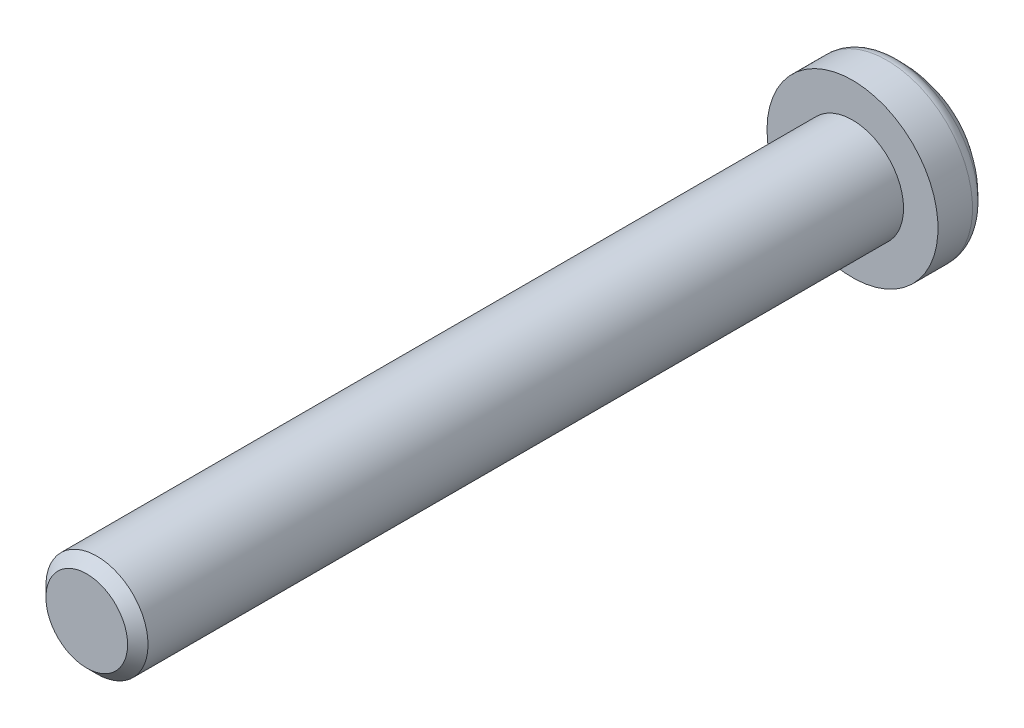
ISO-10303-21;
HEADER;
FILE_DESCRIPTION(('STEP AP214'),'2;1');
FILE_NAME('part.step','',(''),(''),'','','');
FILE_SCHEMA(('AUTOMOTIVE_DESIGN { 1 0 10303 214 1 1 1 1 }'));
ENDSEC;
DATA;
#1=APPLICATION_CONTEXT('core data for automotive mechanical design processes');
#2=APPLICATION_PROTOCOL_DEFINITION('international standard','automotive_design',2000,#1);
#3=PRODUCT_CONTEXT('',#1,'mechanical');
#4=PRODUCT('Part','Part','',(#3));
#5=PRODUCT_RELATED_PRODUCT_CATEGORY('part','',(#4));
#6=PRODUCT_DEFINITION_FORMATION('','',#4);
#7=PRODUCT_DEFINITION_CONTEXT('part definition',#1,'design');
#8=PRODUCT_DEFINITION('design','',#6,#7);
#9=PRODUCT_DEFINITION_SHAPE('','',#8);
#10=(LENGTH_UNIT() NAMED_UNIT(*) SI_UNIT(.MILLI.,.METRE.));
#11=(NAMED_UNIT(*) PLANE_ANGLE_UNIT() SI_UNIT($,.RADIAN.));
#12=(NAMED_UNIT(*) SI_UNIT($,.STERADIAN.) SOLID_ANGLE_UNIT());
#13=UNCERTAINTY_MEASURE_WITH_UNIT(LENGTH_MEASURE(1.E-05),#10,'distance_accuracy_value','');
#14=(GEOMETRIC_REPRESENTATION_CONTEXT(3) GLOBAL_UNCERTAINTY_ASSIGNED_CONTEXT((#13)) GLOBAL_UNIT_ASSIGNED_CONTEXT((#10,
#11,#12)) REPRESENTATION_CONTEXT('',''));
#15=CARTESIAN_POINT('',(0.,0.,0.));
#16=DIRECTION('',(0.,0.,1.));
#17=DIRECTION('',(1.,0.,0.));
#18=AXIS2_PLACEMENT_3D('',#15,#16,#17);
#19=CARTESIAN_POINT('',(0.,0.,1.29516129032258));
#20=DIRECTION('',(0.,0.,-1.));
#21=DIRECTION('',(1.,0.,0.));
#22=AXIS2_PLACEMENT_3D('',#19,#20,#21);
#23=SPHERICAL_SURFACE('',#22,4.39516129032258);
#24=CARTESIAN_POINT('',(0.,0.,-1.70623740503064));
#25=DIRECTION('',(0.,0.,-1.));
#26=DIRECTION('',(-1.,0.,0.));
#27=AXIS2_PLACEMENT_3D('',#24,#25,#26);
#28=CIRCLE('',#27,3.21077072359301);
#29=CARTESIAN_POINT('',(-3.21077072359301,0.,-1.70623740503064));
#30=VERTEX_POINT('',#29);
#31=EDGE_CURVE('E152',#30,#30,#28,.T.);
#32=ORIENTED_EDGE('',*,*,#31,.T.);
#33=EDGE_LOOP('',(#32));
#34=FACE_BOUND('',#33,.T.);
#35=CARTESIAN_POINT('',(-2.35,0.,1.29516129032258));
#36=DIRECTION('',(1.,0.,0.));
#37=DIRECTION('',(0.,0.,-1.));
#38=AXIS2_PLACEMENT_3D('',#35,#36,#37);
#39=CIRCLE('',#38,3.71415438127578);
#40=CARTESIAN_POINT('',(-2.35,-0.6,-2.37020946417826));
#41=VERTEX_POINT('',#40);
#42=CARTESIAN_POINT('',(-2.35,0.6,-2.37020946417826));
#43=VERTEX_POINT('',#42);
#44=EDGE_CURVE('E176',#41,#43,#39,.T.);
#45=ORIENTED_EDGE('',*,*,#44,.F.);
#46=CARTESIAN_POINT('',(0.,-0.6,1.29516129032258));
#47=DIRECTION('',(0.,1.,0.));
#48=DIRECTION('',(-1.,0.,0.));
#49=AXIS2_PLACEMENT_3D('',#46,#47,#48);
#50=CIRCLE('',#49,4.35401455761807);
#51=CARTESIAN_POINT('',(-0.6,-0.6,-3.01731395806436));
#52=VERTEX_POINT('',#51);
#53=EDGE_CURVE('E56',#52,#41,#50,.T.);
#54=ORIENTED_EDGE('',*,*,#53,.F.);
#55=CARTESIAN_POINT('',(-0.6,0.,1.29516129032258));
#56=DIRECTION('',(1.,0.,0.));
#57=DIRECTION('',(0.,1.,0.));
#58=AXIS2_PLACEMENT_3D('',#55,#56,#57);
#59=CIRCLE('',#58,4.35401455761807);
#60=CARTESIAN_POINT('',(-0.6,-2.35,-2.37020946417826));
#61=VERTEX_POINT('',#60);
#62=EDGE_CURVE('E173',#61,#52,#59,.T.);
#63=ORIENTED_EDGE('',*,*,#62,.F.);
#64=CARTESIAN_POINT('',(0.,-2.35,1.29516129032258));
#65=DIRECTION('',(0.,1.,0.));
#66=DIRECTION('',(0.,0.,1.));
#67=AXIS2_PLACEMENT_3D('',#64,#65,#66);
#68=CIRCLE('',#67,3.71415438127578);
#69=CARTESIAN_POINT('',(0.6,-2.35,-2.37020946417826));
#70=VERTEX_POINT('',#69);
#71=EDGE_CURVE('E171',#70,#61,#68,.T.);
#72=ORIENTED_EDGE('',*,*,#71,.F.);
#73=CARTESIAN_POINT('',(0.6,0.,1.29516129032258));
#74=DIRECTION('',(-1.,0.,0.));
#75=DIRECTION('',(0.,-1.,0.));
#76=AXIS2_PLACEMENT_3D('',#73,#74,#75);
#77=CIRCLE('',#76,4.35401455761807);
#78=CARTESIAN_POINT('',(0.6,-0.6,-3.01731395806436));
#79=VERTEX_POINT('',#78);
#80=EDGE_CURVE('E169',#79,#70,#77,.T.);
#81=ORIENTED_EDGE('',*,*,#80,.F.);
#82=CARTESIAN_POINT('',(0.,-0.6,1.29516129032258));
#83=DIRECTION('',(0.,1.,0.));
#84=DIRECTION('',(-1.,0.,0.));
#85=AXIS2_PLACEMENT_3D('',#82,#83,#84);
#86=CIRCLE('',#85,4.35401455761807);
#87=CARTESIAN_POINT('',(2.35,-0.6,-2.37020946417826));
#88=VERTEX_POINT('',#87);
#89=EDGE_CURVE('E167',#88,#79,#86,.T.);
#90=ORIENTED_EDGE('',*,*,#89,.F.);
#91=CARTESIAN_POINT('',(2.35,0.,1.29516129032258));
#92=DIRECTION('',(-1.,0.,0.));
#93=DIRECTION('',(0.,-1.,0.));
#94=AXIS2_PLACEMENT_3D('',#91,#92,#93);
#95=CIRCLE('',#94,3.71415438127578);
#96=CARTESIAN_POINT('',(2.35,0.6,-2.37020946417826));
#97=VERTEX_POINT('',#96);
#98=EDGE_CURVE('E165',#97,#88,#95,.T.);
#99=ORIENTED_EDGE('',*,*,#98,.F.);
#100=CARTESIAN_POINT('',(0.,0.6,1.29516129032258));
#101=DIRECTION('',(0.,-1.,0.));
#102=DIRECTION('',(1.,0.,0.));
#103=AXIS2_PLACEMENT_3D('',#100,#101,#102);
#104=CIRCLE('',#103,4.35401455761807);
#105=CARTESIAN_POINT('',(0.6,0.6,-3.01731395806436));
#106=VERTEX_POINT('',#105);
#107=EDGE_CURVE('E163',#106,#97,#104,.T.);
#108=ORIENTED_EDGE('',*,*,#107,.F.);
#109=CARTESIAN_POINT('',(0.6,0.,1.29516129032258));
#110=DIRECTION('',(-1.,0.,0.));
#111=DIRECTION('',(0.,-1.,0.));
#112=AXIS2_PLACEMENT_3D('',#109,#110,#111);
#113=CIRCLE('',#112,4.35401455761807);
#114=CARTESIAN_POINT('',(0.6,2.35,-2.37020946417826));
#115=VERTEX_POINT('',#114);
#116=EDGE_CURVE('E161',#115,#106,#113,.T.);
#117=ORIENTED_EDGE('',*,*,#116,.F.);
#118=CARTESIAN_POINT('',(0.,2.35,1.29516129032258));
#119=DIRECTION('',(0.,-1.,0.));
#120=DIRECTION('',(0.,0.,-1.));
#121=AXIS2_PLACEMENT_3D('',#118,#119,#120);
#122=CIRCLE('',#121,3.71415438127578);
#123=CARTESIAN_POINT('',(-0.6,2.35,-2.37020946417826));
#124=VERTEX_POINT('',#123);
#125=EDGE_CURVE('E159',#124,#115,#122,.T.);
#126=ORIENTED_EDGE('',*,*,#125,.F.);
#127=CARTESIAN_POINT('',(-0.6,0.,1.29516129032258));
#128=DIRECTION('',(1.,0.,0.));
#129=DIRECTION('',(0.,1.,0.));
#130=AXIS2_PLACEMENT_3D('',#127,#128,#129);
#131=CIRCLE('',#130,4.35401455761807);
#132=CARTESIAN_POINT('',(-0.6,0.6,-3.01731395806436));
#133=VERTEX_POINT('',#132);
#134=EDGE_CURVE('E157',#133,#124,#131,.T.);
#135=ORIENTED_EDGE('',*,*,#134,.F.);
#136=CARTESIAN_POINT('',(0.,0.6,1.29516129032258));
#137=DIRECTION('',(0.,-1.,0.));
#138=DIRECTION('',(1.,0.,0.));
#139=AXIS2_PLACEMENT_3D('',#136,#137,#138);
#140=CIRCLE('',#139,4.35401455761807);
#141=EDGE_CURVE('E155',#43,#133,#140,.T.);
#142=ORIENTED_EDGE('',*,*,#141,.F.);
#143=EDGE_LOOP('',(#45,#54,#63,#72,#81,#90,#99,#108,#117,#126,#135,#142));
#144=FACE_BOUND('',#143,.T.);
#145=ADVANCED_FACE('F34',(#34,#144),#23,.T.);
#146=CARTESIAN_POINT('',(0.,0.,-1.3534124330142));
#147=DIRECTION('',(0.,0.,-1.));
#148=DIRECTION('',(-1.,0.,0.));
#149=AXIS2_PLACEMENT_3D('',#146,#147,#148);
#150=TOROIDAL_SURFACE('',#149,2.83333333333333,0.516666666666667);
#151=ORIENTED_EDGE('',*,*,#31,.F.);
#152=EDGE_LOOP('',(#151));
#153=FACE_BOUND('',#152,.T.);
#154=CARTESIAN_POINT('',(0.,0.,-1.3534124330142));
#155=DIRECTION('',(0.,0.,-1.));
#156=DIRECTION('',(-1.,0.,0.));
#157=AXIS2_PLACEMENT_3D('',#154,#155,#156);
#158=CIRCLE('',#157,3.35);
#159=CARTESIAN_POINT('',(-3.35,0.,-1.3534124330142));
#160=VERTEX_POINT('',#159);
#161=EDGE_CURVE('E144',#160,#160,#158,.T.);
#162=ORIENTED_EDGE('',*,*,#161,.T.);
#163=EDGE_LOOP('',(#162));
#164=FACE_BOUND('',#163,.T.);
#165=ADVANCED_FACE('F194',(#153,#164),#150,.T.);
#166=CARTESIAN_POINT('',(0.,0.,0.));
#167=DIRECTION('',(0.,0.,-1.));
#168=DIRECTION('',(-1.,0.,0.));
#169=AXIS2_PLACEMENT_3D('',#166,#167,#168);
#170=CYLINDRICAL_SURFACE('',#169,3.35);
#171=ORIENTED_EDGE('',*,*,#161,.F.);
#172=EDGE_LOOP('',(#171));
#173=FACE_BOUND('',#172,.T.);
#174=CARTESIAN_POINT('',(0.,0.,0.));
#175=DIRECTION('',(0.,0.,-1.));
#176=DIRECTION('',(-1.,0.,0.));
#177=AXIS2_PLACEMENT_3D('',#174,#175,#176);
#178=CIRCLE('',#177,3.35);
#179=CARTESIAN_POINT('',(-3.35,0.,0.));
#180=VERTEX_POINT('',#179);
#181=EDGE_CURVE('E140',#180,#180,#178,.T.);
#182=ORIENTED_EDGE('',*,*,#181,.T.);
#183=EDGE_LOOP('',(#182));
#184=FACE_BOUND('',#183,.T.);
#185=ADVANCED_FACE('F199',(#173,#184),#170,.T.);
#186=CARTESIAN_POINT('',(0.,0.,0.));
#187=DIRECTION('',(0.,0.,-1.));
#188=DIRECTION('',(-1.,0.,0.));
#189=AXIS2_PLACEMENT_3D('',#186,#187,#188);
#190=PLANE('',#189);
#191=CARTESIAN_POINT('',(0.,0.,0.));
#192=DIRECTION('',(0.,0.,1.));
#193=DIRECTION('',(1.,0.,0.));
#194=AXIS2_PLACEMENT_3D('',#191,#192,#193);
#195=CIRCLE('',#194,2.);
#196=CARTESIAN_POINT('',(2.,0.,0.));
#197=VERTEX_POINT('',#196);
#198=EDGE_CURVE('E137',#197,#197,#195,.T.);
#199=ORIENTED_EDGE('',*,*,#198,.F.);
#200=EDGE_LOOP('',(#199));
#201=FACE_BOUND('',#200,.T.);
#202=ORIENTED_EDGE('',*,*,#181,.F.);
#203=EDGE_LOOP('',(#202));
#204=FACE_BOUND('',#203,.T.);
#205=ADVANCED_FACE('F311',(#201,#204),#190,.F.);
#206=CARTESIAN_POINT('',(-2.35,0.6,-2.1));
#207=DIRECTION('',(1.,0.,0.));
#208=DIRECTION('',(0.,0.,-1.));
#209=AXIS2_PLACEMENT_3D('',#206,#207,#208);
#210=PLANE('',#209);
#211=ORIENTED_EDGE('',*,*,#44,.T.);
#212=DIRECTION('',(0.,0.,-1.));
#213=VECTOR('',#212,1.);
#214=CARTESIAN_POINT('',(-2.35,0.6,-2.1));
#215=LINE('',#214,#213);
#216=CARTESIAN_POINT('',(-2.35,0.6,-2.1));
#217=VERTEX_POINT('',#216);
#218=EDGE_CURVE('E48',#217,#43,#215,.T.);
#219=ORIENTED_EDGE('',*,*,#218,.F.);
#220=DIRECTION('',(0.,-1.,0.));
#221=VECTOR('',#220,1.);
#222=CARTESIAN_POINT('',(-2.35,0.6,-2.1));
#223=LINE('',#222,#221);
#224=CARTESIAN_POINT('',(-2.35,-0.6,-2.1));
#225=VERTEX_POINT('',#224);
#226=EDGE_CURVE('E128',#217,#225,#223,.T.);
#227=ORIENTED_EDGE('',*,*,#226,.T.);
#228=DIRECTION('',(0.,0.,-1.));
#229=VECTOR('',#228,1.);
#230=CARTESIAN_POINT('',(-2.35,-0.6,-2.1));
#231=LINE('',#230,#229);
#232=EDGE_CURVE('E135',#225,#41,#231,.T.);
#233=ORIENTED_EDGE('',*,*,#232,.T.);
#234=EDGE_LOOP('',(#211,#219,#227,#233));
#235=FACE_BOUND('',#234,.T.);
#236=ADVANCED_FACE('F134',(#235),#210,.T.);
#237=CARTESIAN_POINT('',(-2.35,-0.6,-2.1));
#238=DIRECTION('',(0.,1.,0.));
#239=DIRECTION('',(-1.,0.,0.));
#240=AXIS2_PLACEMENT_3D('',#237,#238,#239);
#241=PLANE('',#240);
#242=ORIENTED_EDGE('',*,*,#53,.T.);
#243=ORIENTED_EDGE('',*,*,#232,.F.);
#244=DIRECTION('',(1.,0.,0.));
#245=VECTOR('',#244,1.);
#246=CARTESIAN_POINT('',(-2.35,-0.6,-2.1));
#247=LINE('',#246,#245);
#248=CARTESIAN_POINT('',(-0.6,-0.6,-2.1));
#249=VERTEX_POINT('',#248);
#250=EDGE_CURVE('E124',#225,#249,#247,.T.);
#251=ORIENTED_EDGE('',*,*,#250,.T.);
#252=DIRECTION('',(0.,0.,-1.));
#253=VECTOR('',#252,1.);
#254=CARTESIAN_POINT('',(-0.6,-0.6,-2.1));
#255=LINE('',#254,#253);
#256=EDGE_CURVE('E141',#249,#52,#255,.T.);
#257=ORIENTED_EDGE('',*,*,#256,.T.);
#258=EDGE_LOOP('',(#242,#243,#251,#257));
#259=FACE_BOUND('',#258,.T.);
#260=ADVANCED_FACE('F139',(#259),#241,.T.);
#261=CARTESIAN_POINT('',(-0.6,-0.6,-2.1));
#262=DIRECTION('',(1.,0.,0.));
#263=DIRECTION('',(0.,1.,0.));
#264=AXIS2_PLACEMENT_3D('',#261,#262,#263);
#265=PLANE('',#264);
#266=ORIENTED_EDGE('',*,*,#62,.T.);
#267=ORIENTED_EDGE('',*,*,#256,.F.);
#268=DIRECTION('',(0.,-1.,0.));
#269=VECTOR('',#268,1.);
#270=CARTESIAN_POINT('',(-0.6,-0.6,-2.1));
#271=LINE('',#270,#269);
#272=CARTESIAN_POINT('',(-0.6,-2.35,-2.1));
#273=VERTEX_POINT('',#272);
#274=EDGE_CURVE('E130',#249,#273,#271,.T.);
#275=ORIENTED_EDGE('',*,*,#274,.T.);
#276=DIRECTION('',(0.,0.,-1.));
#277=VECTOR('',#276,1.);
#278=CARTESIAN_POINT('',(-0.6,-2.35,-2.1));
#279=LINE('',#278,#277);
#280=EDGE_CURVE('E146',#273,#61,#279,.T.);
#281=ORIENTED_EDGE('',*,*,#280,.T.);
#282=EDGE_LOOP('',(#266,#267,#275,#281));
#283=FACE_BOUND('',#282,.T.);
#284=ADVANCED_FACE('F244',(#283),#265,.T.);
#285=CARTESIAN_POINT('',(-0.6,-2.35,-2.1));
#286=DIRECTION('',(0.,1.,0.));
#287=DIRECTION('',(0.,0.,1.));
#288=AXIS2_PLACEMENT_3D('',#285,#286,#287);
#289=PLANE('',#288);
#290=ORIENTED_EDGE('',*,*,#71,.T.);
#291=ORIENTED_EDGE('',*,*,#280,.F.);
#292=DIRECTION('',(1.,0.,0.));
#293=VECTOR('',#292,1.);
#294=CARTESIAN_POINT('',(-0.6,-2.35,-2.1));
#295=LINE('',#294,#293);
#296=CARTESIAN_POINT('',(0.6,-2.35,-2.1));
#297=VERTEX_POINT('',#296);
#298=EDGE_CURVE('E251',#273,#297,#295,.T.);
#299=ORIENTED_EDGE('',*,*,#298,.T.);
#300=DIRECTION('',(0.,0.,-1.));
#301=VECTOR('',#300,1.);
#302=CARTESIAN_POINT('',(0.6,-2.35,-2.1));
#303=LINE('',#302,#301);
#304=EDGE_CURVE('E239',#297,#70,#303,.T.);
#305=ORIENTED_EDGE('',*,*,#304,.T.);
#306=EDGE_LOOP('',(#290,#291,#299,#305));
#307=FACE_BOUND('',#306,.T.);
#308=ADVANCED_FACE('F249',(#307),#289,.T.);
#309=CARTESIAN_POINT('',(0.6,-0.6,-2.1));
#310=DIRECTION('',(-1.,0.,0.));
#311=DIRECTION('',(0.,-1.,0.));
#312=AXIS2_PLACEMENT_3D('',#309,#310,#311);
#313=PLANE('',#312);
#314=ORIENTED_EDGE('',*,*,#80,.T.);
#315=ORIENTED_EDGE('',*,*,#304,.F.);
#316=DIRECTION('',(0.,1.,0.));
#317=VECTOR('',#316,1.);
#318=CARTESIAN_POINT('',(0.6,-0.6,-2.1));
#319=LINE('',#318,#317);
#320=CARTESIAN_POINT('',(0.6,-0.6,-2.1));
#321=VERTEX_POINT('',#320);
#322=EDGE_CURVE('E255',#297,#321,#319,.T.);
#323=ORIENTED_EDGE('',*,*,#322,.T.);
#324=DIRECTION('',(0.,0.,-1.));
#325=VECTOR('',#324,1.);
#326=CARTESIAN_POINT('',(0.6,-0.6,-2.1));
#327=LINE('',#326,#325);
#328=EDGE_CURVE('E236',#321,#79,#327,.T.);
#329=ORIENTED_EDGE('',*,*,#328,.T.);
#330=EDGE_LOOP('',(#314,#315,#323,#329));
#331=FACE_BOUND('',#330,.T.);
#332=ADVANCED_FACE('F254',(#331),#313,.T.);
#333=CARTESIAN_POINT('',(0.6,-0.6,-2.1));
#334=DIRECTION('',(0.,1.,0.));
#335=DIRECTION('',(-1.,0.,0.));
#336=AXIS2_PLACEMENT_3D('',#333,#334,#335);
#337=PLANE('',#336);
#338=ORIENTED_EDGE('',*,*,#89,.T.);
#339=ORIENTED_EDGE('',*,*,#328,.F.);
#340=DIRECTION('',(1.,0.,0.));
#341=VECTOR('',#340,1.);
#342=CARTESIAN_POINT('',(0.6,-0.6,-2.1));
#343=LINE('',#342,#341);
#344=CARTESIAN_POINT('',(2.35,-0.6,-2.1));
#345=VERTEX_POINT('',#344);
#346=EDGE_CURVE('E259',#321,#345,#343,.T.);
#347=ORIENTED_EDGE('',*,*,#346,.T.);
#348=DIRECTION('',(0.,0.,-1.));
#349=VECTOR('',#348,1.);
#350=CARTESIAN_POINT('',(2.35,-0.6,-2.1));
#351=LINE('',#350,#349);
#352=EDGE_CURVE('E233',#345,#88,#351,.T.);
#353=ORIENTED_EDGE('',*,*,#352,.T.);
#354=EDGE_LOOP('',(#338,#339,#347,#353));
#355=FACE_BOUND('',#354,.T.);
#356=ADVANCED_FACE('F292',(#355),#337,.T.);
#357=CARTESIAN_POINT('',(2.35,0.6,-2.1));
#358=DIRECTION('',(-1.,0.,0.));
#359=DIRECTION('',(0.,-1.,0.));
#360=AXIS2_PLACEMENT_3D('',#357,#358,#359);
#361=PLANE('',#360);
#362=ORIENTED_EDGE('',*,*,#98,.T.);
#363=ORIENTED_EDGE('',*,*,#352,.F.);
#364=DIRECTION('',(0.,1.,0.));
#365=VECTOR('',#364,1.);
#366=CARTESIAN_POINT('',(2.35,0.6,-2.1));
#367=LINE('',#366,#365);
#368=CARTESIAN_POINT('',(2.35,0.6,-2.1));
#369=VERTEX_POINT('',#368);
#370=EDGE_CURVE('E261',#345,#369,#367,.T.);
#371=ORIENTED_EDGE('',*,*,#370,.T.);
#372=DIRECTION('',(0.,0.,-1.));
#373=VECTOR('',#372,1.);
#374=CARTESIAN_POINT('',(2.35,0.6,-2.1));
#375=LINE('',#374,#373);
#376=EDGE_CURVE('E230',#369,#97,#375,.T.);
#377=ORIENTED_EDGE('',*,*,#376,.T.);
#378=EDGE_LOOP('',(#362,#363,#371,#377));
#379=FACE_BOUND('',#378,.T.);
#380=ADVANCED_FACE('F289',(#379),#361,.T.);
#381=CARTESIAN_POINT('',(0.6,0.6,-2.1));
#382=DIRECTION('',(0.,-1.,0.));
#383=DIRECTION('',(1.,0.,0.));
#384=AXIS2_PLACEMENT_3D('',#381,#382,#383);
#385=PLANE('',#384);
#386=ORIENTED_EDGE('',*,*,#107,.T.);
#387=ORIENTED_EDGE('',*,*,#376,.F.);
#388=DIRECTION('',(-1.,0.,0.));
#389=VECTOR('',#388,1.);
#390=CARTESIAN_POINT('',(0.6,0.6,-2.1));
#391=LINE('',#390,#389);
#392=CARTESIAN_POINT('',(0.6,0.6,-2.1));
#393=VERTEX_POINT('',#392);
#394=EDGE_CURVE('E267',#369,#393,#391,.T.);
#395=ORIENTED_EDGE('',*,*,#394,.T.);
#396=DIRECTION('',(0.,0.,-1.));
#397=VECTOR('',#396,1.);
#398=CARTESIAN_POINT('',(0.6,0.6,-2.1));
#399=LINE('',#398,#397);
#400=EDGE_CURVE('E227',#393,#106,#399,.T.);
#401=ORIENTED_EDGE('',*,*,#400,.T.);
#402=EDGE_LOOP('',(#386,#387,#395,#401));
#403=FACE_BOUND('',#402,.T.);
#404=ADVANCED_FACE('F287',(#403),#385,.T.);
#405=CARTESIAN_POINT('',(0.6,2.35,-2.1));
#406=DIRECTION('',(-1.,0.,0.));
#407=DIRECTION('',(0.,-1.,0.));
#408=AXIS2_PLACEMENT_3D('',#405,#406,#407);
#409=PLANE('',#408);
#410=ORIENTED_EDGE('',*,*,#116,.T.);
#411=ORIENTED_EDGE('',*,*,#400,.F.);
#412=DIRECTION('',(0.,1.,0.));
#413=VECTOR('',#412,1.);
#414=CARTESIAN_POINT('',(0.6,2.35,-2.1));
#415=LINE('',#414,#413);
#416=CARTESIAN_POINT('',(0.6,2.35,-2.1));
#417=VERTEX_POINT('',#416);
#418=EDGE_CURVE('E269',#393,#417,#415,.T.);
#419=ORIENTED_EDGE('',*,*,#418,.T.);
#420=DIRECTION('',(0.,0.,-1.));
#421=VECTOR('',#420,1.);
#422=CARTESIAN_POINT('',(0.6,2.35,-2.1));
#423=LINE('',#422,#421);
#424=EDGE_CURVE('E219',#417,#115,#423,.T.);
#425=ORIENTED_EDGE('',*,*,#424,.T.);
#426=EDGE_LOOP('',(#410,#411,#419,#425));
#427=FACE_BOUND('',#426,.T.);
#428=ADVANCED_FACE('F281',(#427),#409,.T.);
#429=CARTESIAN_POINT('',(-0.6,2.35,-2.1));
#430=DIRECTION('',(0.,-1.,0.));
#431=DIRECTION('',(0.,0.,-1.));
#432=AXIS2_PLACEMENT_3D('',#429,#430,#431);
#433=PLANE('',#432);
#434=ORIENTED_EDGE('',*,*,#125,.T.);
#435=ORIENTED_EDGE('',*,*,#424,.F.);
#436=DIRECTION('',(-1.,0.,0.));
#437=VECTOR('',#436,1.);
#438=CARTESIAN_POINT('',(-0.6,2.35,-2.1));
#439=LINE('',#438,#437);
#440=CARTESIAN_POINT('',(-0.6,2.35,-2.1));
#441=VERTEX_POINT('',#440);
#442=EDGE_CURVE('E271',#417,#441,#439,.T.);
#443=ORIENTED_EDGE('',*,*,#442,.T.);
#444=DIRECTION('',(0.,0.,-1.));
#445=VECTOR('',#444,1.);
#446=CARTESIAN_POINT('',(-0.6,2.35,-2.1));
#447=LINE('',#446,#445);
#448=EDGE_CURVE('E217',#441,#124,#447,.T.);
#449=ORIENTED_EDGE('',*,*,#448,.T.);
#450=EDGE_LOOP('',(#434,#435,#443,#449));
#451=FACE_BOUND('',#450,.T.);
#452=ADVANCED_FACE('F278',(#451),#433,.T.);
#453=CARTESIAN_POINT('',(-0.6,2.35,-2.1));
#454=DIRECTION('',(1.,0.,0.));
#455=DIRECTION('',(0.,1.,0.));
#456=AXIS2_PLACEMENT_3D('',#453,#454,#455);
#457=PLANE('',#456);
#458=ORIENTED_EDGE('',*,*,#134,.T.);
#459=ORIENTED_EDGE('',*,*,#448,.F.);
#460=DIRECTION('',(0.,-1.,0.));
#461=VECTOR('',#460,1.);
#462=CARTESIAN_POINT('',(-0.6,2.35,-2.1));
#463=LINE('',#462,#461);
#464=CARTESIAN_POINT('',(-0.6,0.6,-2.1));
#465=VERTEX_POINT('',#464);
#466=EDGE_CURVE('E216',#441,#465,#463,.T.);
#467=ORIENTED_EDGE('',*,*,#466,.T.);
#468=DIRECTION('',(0.,0.,-1.));
#469=VECTOR('',#468,1.);
#470=CARTESIAN_POINT('',(-0.6,0.6,-2.1));
#471=LINE('',#470,#469);
#472=EDGE_CURVE('E210',#465,#133,#471,.T.);
#473=ORIENTED_EDGE('',*,*,#472,.T.);
#474=EDGE_LOOP('',(#458,#459,#467,#473));
#475=FACE_BOUND('',#474,.T.);
#476=ADVANCED_FACE('F212',(#475),#457,.T.);
#477=CARTESIAN_POINT('',(-2.35,0.6,-2.1));
#478=DIRECTION('',(0.,-1.,0.));
#479=DIRECTION('',(1.,0.,0.));
#480=AXIS2_PLACEMENT_3D('',#477,#478,#479);
#481=PLANE('',#480);
#482=ORIENTED_EDGE('',*,*,#141,.T.);
#483=ORIENTED_EDGE('',*,*,#472,.F.);
#484=DIRECTION('',(-1.,0.,0.));
#485=VECTOR('',#484,1.);
#486=CARTESIAN_POINT('',(-2.35,0.6,-2.1));
#487=LINE('',#486,#485);
#488=EDGE_CURVE('E221',#465,#217,#487,.T.);
#489=ORIENTED_EDGE('',*,*,#488,.T.);
#490=ORIENTED_EDGE('',*,*,#218,.T.);
#491=EDGE_LOOP('',(#482,#483,#489,#490));
#492=FACE_BOUND('',#491,.T.);
#493=ADVANCED_FACE('F209',(#492),#481,.T.);
#494=CARTESIAN_POINT('',(-2.35,-2.35,-2.1));
#495=DIRECTION('',(0.,0.,1.));
#496=DIRECTION('',(1.,0.,0.));
#497=AXIS2_PLACEMENT_3D('',#494,#495,#496);
#498=PLANE('',#497);
#499=ORIENTED_EDGE('',*,*,#226,.F.);
#500=ORIENTED_EDGE('',*,*,#488,.F.);
#501=ORIENTED_EDGE('',*,*,#466,.F.);
#502=ORIENTED_EDGE('',*,*,#442,.F.);
#503=ORIENTED_EDGE('',*,*,#418,.F.);
#504=ORIENTED_EDGE('',*,*,#394,.F.);
#505=ORIENTED_EDGE('',*,*,#370,.F.);
#506=ORIENTED_EDGE('',*,*,#346,.F.);
#507=ORIENTED_EDGE('',*,*,#322,.F.);
#508=ORIENTED_EDGE('',*,*,#298,.F.);
#509=ORIENTED_EDGE('',*,*,#274,.F.);
#510=ORIENTED_EDGE('',*,*,#250,.F.);
#511=EDGE_LOOP('',(#499,#500,#501,#502,#503,#504,#505,#506,#507,#508,#509,#510));
#512=FACE_BOUND('',#511,.T.);
#513=ADVANCED_FACE('F126',(#512),#498,.F.);
#514=CARTESIAN_POINT('',(0.,0.,30.));
#515=DIRECTION('',(0.,0.,1.));
#516=DIRECTION('',(1.,0.,0.));
#517=AXIS2_PLACEMENT_3D('',#514,#515,#516);
#518=PLANE('',#517);
#519=CARTESIAN_POINT('',(0.,0.,30.));
#520=DIRECTION('',(0.,0.,1.));
#521=DIRECTION('',(1.,0.,0.));
#522=AXIS2_PLACEMENT_3D('',#519,#520,#521);
#523=CIRCLE('',#522,1.6);
#524=CARTESIAN_POINT('',(1.6,0.,30.));
#525=VERTEX_POINT('',#524);
#526=EDGE_CURVE('E41',#525,#525,#523,.T.);
#527=ORIENTED_EDGE('',*,*,#526,.T.);
#528=EDGE_LOOP('',(#527));
#529=FACE_BOUND('',#528,.T.);
#530=ADVANCED_FACE('F180',(#529),#518,.T.);
#531=CARTESIAN_POINT('',(0.,0.,0.));
#532=DIRECTION('',(0.,0.,1.));
#533=DIRECTION('',(1.,0.,0.));
#534=AXIS2_PLACEMENT_3D('',#531,#532,#533);
#535=CYLINDRICAL_SURFACE('',#534,2.);
#536=CARTESIAN_POINT('',(0.,0.,29.6));
#537=DIRECTION('',(0.,0.,1.));
#538=DIRECTION('',(1.,0.,0.));
#539=AXIS2_PLACEMENT_3D('',#536,#537,#538);
#540=CIRCLE('',#539,2.);
#541=CARTESIAN_POINT('',(2.,0.,29.6));
#542=VERTEX_POINT('',#541);
#543=EDGE_CURVE('E11',#542,#542,#540,.F.);
#544=ORIENTED_EDGE('',*,*,#543,.T.);
#545=EDGE_LOOP('',(#544));
#546=FACE_BOUND('',#545,.T.);
#547=ORIENTED_EDGE('',*,*,#198,.T.);
#548=EDGE_LOOP('',(#547));
#549=FACE_BOUND('',#548,.T.);
#550=ADVANCED_FACE('F184',(#546,#549),#535,.T.);
#551=CARTESIAN_POINT('',(0.,0.,30.));
#552=DIRECTION('',(0.,0.,-1.));
#553=DIRECTION('',(-1.,0.,0.));
#554=AXIS2_PLACEMENT_3D('',#551,#552,#553);
#555=CONICAL_SURFACE('',#554,1.6,0.785398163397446);
#556=ORIENTED_EDGE('',*,*,#543,.F.);
#557=EDGE_LOOP('',(#556));
#558=FACE_BOUND('',#557,.T.);
#559=ORIENTED_EDGE('',*,*,#526,.F.);
#560=EDGE_LOOP('',(#559));
#561=FACE_BOUND('',#560,.T.);
#562=ADVANCED_FACE('F182',(#558,#561),#555,.T.);
#563=CLOSED_SHELL('',(#145,#165,#185,#205,#236,#260,#284,#308,#332,#356,#380,#404,#428,#452,
#476,#493,#513,#530,#550,#562));
#564=MANIFOLD_SOLID_BREP('B2',#563);
#565=ADVANCED_BREP_SHAPE_REPRESENTATION('',(#18,#564),#14);
#566=SHAPE_DEFINITION_REPRESENTATION(#9,#565);
ENDSEC;
END-ISO-10303-21;
